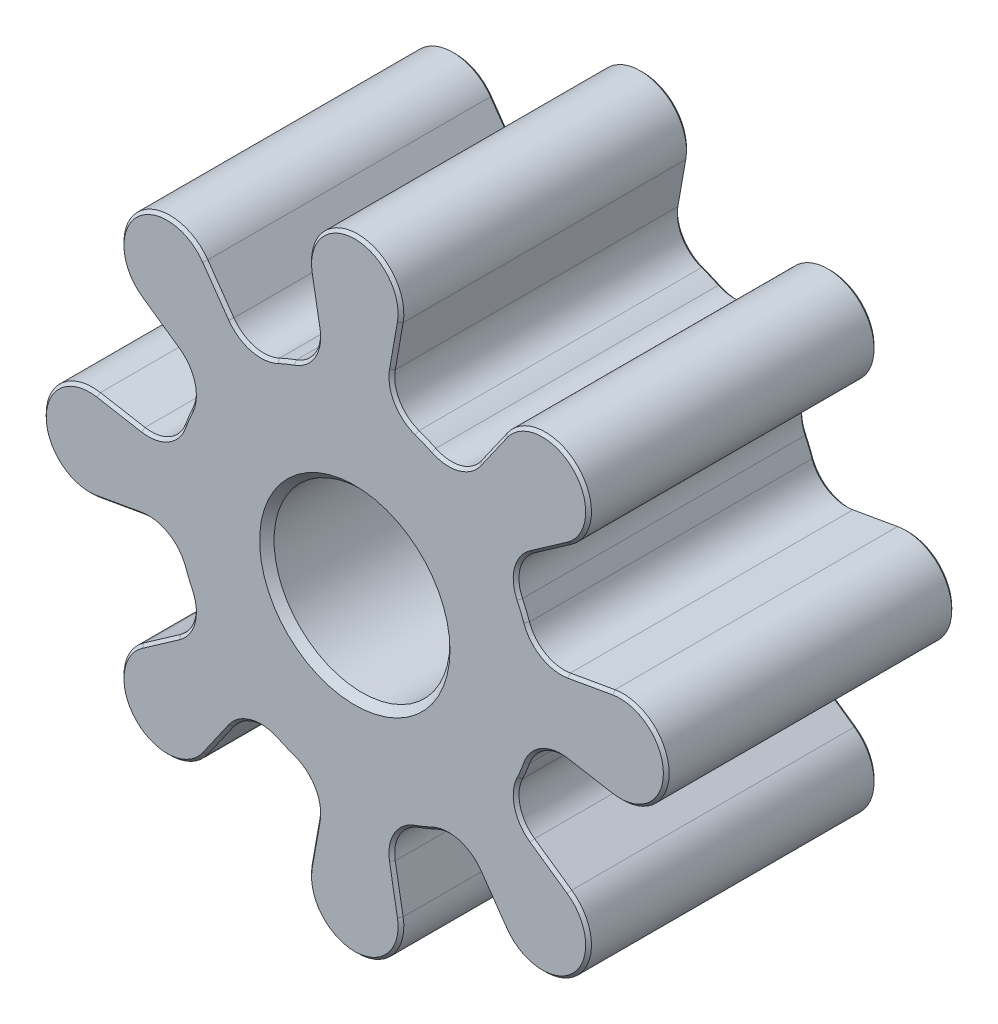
from build123d import *

# Parameters (mm, degrees)
SKETCH_1_R      = 3.05
EXTRUDE_1_DEPTH = 10
CHAMFER_1_SIZE  = 0.25
CHAMFER_2_SIZE  = 0.1


with BuildPart() as part:
    # Sketch 1 → Extrude 1 (new body)
    with BuildSketch(Plane.XY):
        with BuildLine():
            Line((-1.302272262, 7.373954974), (-1.575617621, 8.92173913))
            ThreePointArc((-1.575617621, 8.92173913), (0, 10.8), (1.575617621, 8.92173913))
            Line((1.575617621, 8.92173913), (1.302272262, 7.373954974))
            ThreePointArc((1.302272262, 7.373954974), (1.454973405, 6.514793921), (2.126031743, 5.956980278))
            ThreePointArc((2.126031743, 5.956980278), (2.42047271, 5.843538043), (2.708889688, 5.715552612))
            ThreePointArc((2.708889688, 5.715552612), (3.577833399, 5.635476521), (4.293328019, 6.135019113))
            Line((4.293328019, 6.135019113), (5.194492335, 7.422752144))
            ThreePointArc((5.194492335, 7.422752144), (7.636753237, 7.636753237), (7.422752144, 5.194492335))
            Line((7.422752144, 5.194492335), (6.135019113, 4.293328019))
            ThreePointArc((6.135019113, 4.293328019), (5.635476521, 3.577833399), (5.715552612, 2.708889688))
            ThreePointArc((5.715552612, 2.708889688), (5.843538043, 2.42047271), (5.956980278, 2.126031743))
            ThreePointArc((5.956980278, 2.126031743), (6.514793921, 1.454973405), (7.373954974, 1.302272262))
            Line((7.373954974, 1.302272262), (8.92173913, 1.575617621))
            ThreePointArc((8.92173913, 1.575617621), (10.8, 0), (8.92173913, -1.575617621))
            Line((8.92173913, -1.575617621), (7.373954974, -1.302272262))
            ThreePointArc((7.373954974, -1.302272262), (6.514793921, -1.454973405), (5.956980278, -2.126031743))
            ThreePointArc((5.956980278, -2.126031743), (5.843538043, -2.42047271), (5.715552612, -2.708889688))
            ThreePointArc((5.715552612, -2.708889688), (5.635476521, -3.577833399), (6.135019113, -4.293328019))
            Line((6.135019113, -4.293328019), (7.422752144, -5.194492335))
            ThreePointArc((7.422752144, -5.194492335), (7.636753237, -7.636753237), (5.194492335, -7.422752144))
            Line((5.194492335, -7.422752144), (4.293328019, -6.135019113))
            ThreePointArc((4.293328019, -6.135019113), (3.577833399, -5.635476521), (2.708889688, -5.715552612))
            ThreePointArc((2.708889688, -5.715552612), (2.42047271, -5.843538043), (2.126031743, -5.956980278))
            ThreePointArc((2.126031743, -5.956980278), (1.454973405, -6.514793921), (1.302272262, -7.373954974))
            Line((1.302272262, -7.373954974), (1.575617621, -8.92173913))
            ThreePointArc((1.575617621, -8.92173913), (0, -10.8), (-1.575617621, -8.92173913))
            Line((-1.575617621, -8.92173913), (-1.302272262, -7.373954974))
            ThreePointArc((-1.302272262, -7.373954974), (-1.454973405, -6.514793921), (-2.126031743, -5.956980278))
            ThreePointArc((-2.126031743, -5.956980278), (-2.42047271, -5.843538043), (-2.708889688, -5.715552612))
            ThreePointArc((-2.708889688, -5.715552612), (-3.577833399, -5.635476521), (-4.293328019, -6.135019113))
            Line((-4.293328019, -6.135019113), (-5.194492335, -7.422752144))
            ThreePointArc((-5.194492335, -7.422752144), (-7.636753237, -7.636753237), (-7.422752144, -5.194492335))
            Line((-7.422752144, -5.194492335), (-6.135019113, -4.293328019))
            ThreePointArc((-6.135019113, -4.293328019), (-5.635476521, -3.577833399), (-5.715552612, -2.708889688))
            ThreePointArc((-5.715552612, -2.708889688), (-5.843538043, -2.42047271), (-5.956980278, -2.126031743))
            ThreePointArc((-5.956980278, -2.126031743), (-6.514793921, -1.454973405), (-7.373954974, -1.302272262))
            Line((-7.373954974, -1.302272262), (-8.92173913, -1.575617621))
            ThreePointArc((-8.92173913, -1.575617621), (-10.8, 0), (-8.92173913, 1.575617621))
            Line((-8.92173913, 1.575617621), (-7.373954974, 1.302272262))
            ThreePointArc((-7.373954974, 1.302272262), (-6.514793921, 1.454973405), (-5.956980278, 2.126031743))
            ThreePointArc((-5.956980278, 2.126031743), (-5.843538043, 2.42047271), (-5.715552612, 2.708889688))
            ThreePointArc((-5.715552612, 2.708889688), (-5.635476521, 3.577833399), (-6.135019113, 4.293328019))
            Line((-6.135019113, 4.293328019), (-7.422752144, 5.194492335))
            ThreePointArc((-7.422752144, 5.194492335), (-7.636753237, 7.636753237), (-5.194492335, 7.422752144))
            Line((-5.194492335, 7.422752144), (-4.293328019, 6.135019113))
            ThreePointArc((-4.293328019, 6.135019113), (-3.577833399, 5.635476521), (-2.708889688, 5.715552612))
            ThreePointArc((-2.708889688, 5.715552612), (-2.42047271, 5.843538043), (-2.126031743, 5.956980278))
            ThreePointArc((-2.126031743, 5.956980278), (-1.454973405, 6.514793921), (-1.302272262, 7.373954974))
        make_face()
        Circle(SKETCH_1_R, mode=Mode.SUBTRACT)
    extrude(amount=EXTRUDE_1_DEPTH)

    # Chamfer 1
    chamfer_1_edges = [part.edges().sort_by_distance(p)[0] for p in [
        (-3.05, 0, 0),
        (-3.05, 0, 10),
    ]]
    chamfer(chamfer_1_edges, length=CHAMFER_1_SIZE)

    # Chamfer 2
    chamfer_2_edges = [part.edges().sort_by_distance(p)[0] for p in [
        (-1.454973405, 6.514793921, 10),
        (5.635476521, -3.577833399, 10),
        (5.843538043, -2.42047271, 10),
        (6.514793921, -1.454973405, 10),
        (8.147847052, -1.438944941, 10),
        (10.8, 0, 10),
        (8.147847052, 1.438944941, 10),
        (6.514793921, 1.454973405, 10),
        (5.843538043, 2.42047271, 10),
        (5.635476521, 3.577833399, 10),
        (6.778885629, 4.743910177, 10),
        (-2.42047271, 5.843538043, 10),
        (7.636753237, 7.636753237, 10),
        (4.743910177, 6.778885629, 10),
        (3.577833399, 5.635476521, 10),
        (2.42047271, 5.843538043, 10),
        (1.454973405, 6.514793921, 10),
        (1.438944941, 8.147847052, 10),
        (-3.577833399, 5.635476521, 10),
        (-4.743910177, 6.778885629, 10),
        (-7.636753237, 7.636753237, 10),
        (-6.778885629, 4.743910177, 10),
        (-5.635476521, 3.577833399, 10),
        (-5.843538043, 2.42047271, 10),
        (-6.514793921, 1.454973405, 10),
        (-8.147847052, 1.438944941, 10),
        (1.438944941, 8.147847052, 0),
        (0, 10.8, 10),
        (-10.8, 0, 10),
        (1.454973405, 6.514793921, 0),
        (2.42047271, 5.843538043, 0),
        (3.577833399, 5.635476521, 0),
        (4.743910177, 6.778885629, 0),
        (7.636753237, 7.636753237, 0),
        (6.778885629, 4.743910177, 0),
        (5.635476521, 3.577833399, 0),
        (5.843538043, 2.42047271, 0),
        (-8.147847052, -1.438944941, 10),
        (6.514793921, 1.454973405, 0),
        (8.147847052, 1.438944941, 0),
        (10.8, 0, 0),
        (8.147847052, -1.438944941, 0),
        (6.514793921, -1.454973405, 0),
        (5.843538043, -2.42047271, 0),
        (5.635476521, -3.577833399, 0),
        (-6.514793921, -1.454973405, 10),
        (6.778885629, -4.743910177, 0),
        (7.636753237, -7.636753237, 0),
        (4.743910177, -6.778885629, 0),
        (3.577833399, -5.635476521, 0),
        (2.42047271, -5.843538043, 0),
        (1.454973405, -6.514793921, 0),
        (1.438944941, -8.147847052, 0),
        (0, -10.8, 0),
        (-5.843538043, -2.42047271, 10),
        (-1.438944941, -8.147847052, 0),
        (-1.454973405, -6.514793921, 0),
        (-2.42047271, -5.843538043, 0),
        (-3.577833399, -5.635476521, 0),
        (-4.743910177, -6.778885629, 0),
        (-7.636753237, -7.636753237, 0),
        (-6.778885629, -4.743910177, 0),
        (-5.635476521, -3.577833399, 10),
        (-5.635476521, -3.577833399, 0),
        (-5.843538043, -2.42047271, 0),
        (-6.514793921, -1.454973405, 0),
        (-8.147847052, -1.438944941, 0),
        (-10.8, 0, 0),
        (-8.147847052, 1.438944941, 0),
        (-6.514793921, 1.454973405, 0),
        (-5.843538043, 2.42047271, 0),
        (-6.778885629, -4.743910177, 10),
        (-5.635476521, 3.577833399, 0),
        (-6.778885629, 4.743910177, 0),
        (-7.636753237, 7.636753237, 0),
        (-4.743910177, 6.778885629, 0),
        (-3.577833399, 5.635476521, 0),
        (-2.42047271, 5.843538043, 0),
        (-1.454973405, 6.514793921, 0),
        (-7.636753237, -7.636753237, 10),
        (-1.438944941, 8.147847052, 0),
        (0, 10.8, 0),
        (-4.743910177, -6.778885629, 10),
        (-3.577833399, -5.635476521, 10),
        (-2.42047271, -5.843538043, 10),
        (-1.438944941, 8.147847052, 10),
        (-1.454973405, -6.514793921, 10),
        (-1.438944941, -8.147847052, 10),
        (0, -10.8, 10),
        (1.438944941, -8.147847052, 10),
        (1.454973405, -6.514793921, 10),
        (2.42047271, -5.843538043, 10),
        (3.577833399, -5.635476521, 10),
        (4.743910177, -6.778885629, 10),
        (7.636753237, -7.636753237, 10),
        (6.778885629, -4.743910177, 10),
    ]]
    chamfer(chamfer_2_edges, length=CHAMFER_2_SIZE)


solid = part.part
